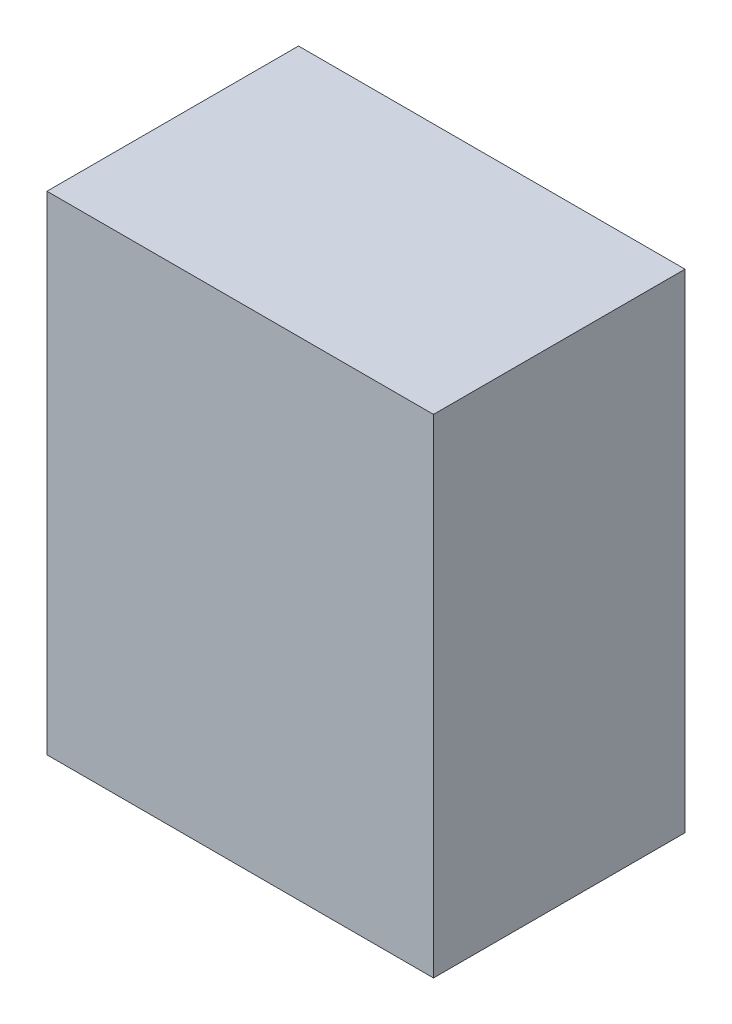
ISO-10303-21;
HEADER;
FILE_DESCRIPTION(('STEP AP214'),'2;1');
FILE_NAME('part.step','',(''),(''),'','','');
FILE_SCHEMA(('AUTOMOTIVE_DESIGN { 1 0 10303 214 1 1 1 1 }'));
ENDSEC;
DATA;
#1=APPLICATION_CONTEXT('core data for automotive mechanical design processes');
#2=APPLICATION_PROTOCOL_DEFINITION('international standard','automotive_design',2000,#1);
#3=PRODUCT_CONTEXT('',#1,'mechanical');
#4=PRODUCT('Part','Part','',(#3));
#5=PRODUCT_RELATED_PRODUCT_CATEGORY('part','',(#4));
#6=PRODUCT_DEFINITION_FORMATION('','',#4);
#7=PRODUCT_DEFINITION_CONTEXT('part definition',#1,'design');
#8=PRODUCT_DEFINITION('design','',#6,#7);
#9=PRODUCT_DEFINITION_SHAPE('','',#8);
#10=(LENGTH_UNIT() NAMED_UNIT(*) SI_UNIT(.MILLI.,.METRE.));
#11=(NAMED_UNIT(*) PLANE_ANGLE_UNIT() SI_UNIT($,.RADIAN.));
#12=(NAMED_UNIT(*) SI_UNIT($,.STERADIAN.) SOLID_ANGLE_UNIT());
#13=UNCERTAINTY_MEASURE_WITH_UNIT(LENGTH_MEASURE(1.E-05),#10,'distance_accuracy_value','');
#14=(GEOMETRIC_REPRESENTATION_CONTEXT(3) GLOBAL_UNCERTAINTY_ASSIGNED_CONTEXT((#13)) GLOBAL_UNIT_ASSIGNED_CONTEXT((#10,
#11,#12)) REPRESENTATION_CONTEXT('',''));
#15=CARTESIAN_POINT('',(0.,0.,0.));
#16=DIRECTION('',(0.,0.,1.));
#17=DIRECTION('',(1.,0.,0.));
#18=AXIS2_PLACEMENT_3D('',#15,#16,#17);
#19=CARTESIAN_POINT('',(169.031366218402,274.692265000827,110.));
#20=DIRECTION('',(-1.,0.,0.));
#21=DIRECTION('',(0.,0.,1.));
#22=AXIS2_PLACEMENT_3D('',#19,#20,#21);
#23=PLANE('',#22);
#24=DIRECTION('',(0.,1.,0.));
#25=VECTOR('',#24,1.);
#26=CARTESIAN_POINT('',(169.031366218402,274.692265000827,-110.));
#27=LINE('',#26,#25);
#28=CARTESIAN_POINT('',(169.031366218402,-152.208498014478,-110.));
#29=VERTEX_POINT('',#28);
#30=CARTESIAN_POINT('',(169.031366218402,274.692265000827,-110.));
#31=VERTEX_POINT('',#30);
#32=EDGE_CURVE('E768',#29,#31,#27,.T.);
#33=ORIENTED_EDGE('',*,*,#32,.T.);
#34=DIRECTION('',(0.,0.,-1.));
#35=VECTOR('',#34,1.);
#36=CARTESIAN_POINT('',(169.031366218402,274.692265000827,110.));
#37=LINE('',#36,#35);
#38=CARTESIAN_POINT('',(169.031366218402,274.692265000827,110.));
#39=VERTEX_POINT('',#38);
#40=EDGE_CURVE('E16',#39,#31,#37,.T.);
#41=ORIENTED_EDGE('',*,*,#40,.F.);
#42=DIRECTION('',(0.,1.,0.));
#43=VECTOR('',#42,1.);
#44=CARTESIAN_POINT('',(169.031366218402,274.692265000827,110.));
#45=LINE('',#44,#43);
#46=CARTESIAN_POINT('',(169.031366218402,-152.208498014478,110.));
#47=VERTEX_POINT('',#46);
#48=EDGE_CURVE('E756',#47,#39,#45,.T.);
#49=ORIENTED_EDGE('',*,*,#48,.F.);
#50=DIRECTION('',(0.,0.,-1.));
#51=VECTOR('',#50,1.);
#52=CARTESIAN_POINT('',(169.031366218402,-152.208498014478,110.));
#53=LINE('',#52,#51);
#54=EDGE_CURVE('E764',#47,#29,#53,.T.);
#55=ORIENTED_EDGE('',*,*,#54,.T.);
#56=EDGE_LOOP('',(#33,#41,#49,#55));
#57=FACE_BOUND('',#56,.T.);
#58=ADVANCED_FACE('F705',(#57),#23,.F.);
#59=CARTESIAN_POINT('',(-169.031366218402,274.692265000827,110.));
#60=DIRECTION('',(0.,-1.,0.));
#61=DIRECTION('',(0.,0.,-1.));
#62=AXIS2_PLACEMENT_3D('',#59,#60,#61);
#63=PLANE('',#62);
#64=DIRECTION('',(-1.,0.,0.));
#65=VECTOR('',#64,1.);
#66=CARTESIAN_POINT('',(-169.031366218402,274.692265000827,-110.));
#67=LINE('',#66,#65);
#68=CARTESIAN_POINT('',(-169.031366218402,274.692265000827,-110.));
#69=VERTEX_POINT('',#68);
#70=EDGE_CURVE('E760',#31,#69,#67,.T.);
#71=ORIENTED_EDGE('',*,*,#70,.T.);
#72=DIRECTION('',(0.,0.,-1.));
#73=VECTOR('',#72,1.);
#74=CARTESIAN_POINT('',(-169.031366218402,274.692265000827,110.));
#75=LINE('',#74,#73);
#76=CARTESIAN_POINT('',(-169.031366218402,274.692265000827,110.));
#77=VERTEX_POINT('',#76);
#78=EDGE_CURVE('E713',#77,#69,#75,.T.);
#79=ORIENTED_EDGE('',*,*,#78,.F.);
#80=DIRECTION('',(-1.,0.,0.));
#81=VECTOR('',#80,1.);
#82=CARTESIAN_POINT('',(-169.031366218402,274.692265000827,110.));
#83=LINE('',#82,#81);
#84=EDGE_CURVE('E751',#39,#77,#83,.T.);
#85=ORIENTED_EDGE('',*,*,#84,.F.);
#86=ORIENTED_EDGE('',*,*,#40,.T.);
#87=EDGE_LOOP('',(#71,#79,#85,#86));
#88=FACE_BOUND('',#87,.T.);
#89=ADVANCED_FACE('F759',(#88),#63,.F.);
#90=CARTESIAN_POINT('',(-169.031366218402,274.692265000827,110.));
#91=DIRECTION('',(1.,0.,0.));
#92=DIRECTION('',(0.,0.,-1.));
#93=AXIS2_PLACEMENT_3D('',#90,#91,#92);
#94=PLANE('',#93);
#95=DIRECTION('',(0.,-1.,0.));
#96=VECTOR('',#95,1.);
#97=CARTESIAN_POINT('',(-169.031366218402,274.692265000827,-110.));
#98=LINE('',#97,#96);
#99=CARTESIAN_POINT('',(-169.031366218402,-152.208498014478,-110.));
#100=VERTEX_POINT('',#99);
#101=EDGE_CURVE('E738',#69,#100,#98,.T.);
#102=ORIENTED_EDGE('',*,*,#101,.T.);
#103=DIRECTION('',(0.,0.,-1.));
#104=VECTOR('',#103,1.);
#105=CARTESIAN_POINT('',(-169.031366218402,-152.208498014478,110.));
#106=LINE('',#105,#104);
#107=CARTESIAN_POINT('',(-169.031366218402,-152.208498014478,110.));
#108=VERTEX_POINT('',#107);
#109=EDGE_CURVE('E761',#108,#100,#106,.T.);
#110=ORIENTED_EDGE('',*,*,#109,.F.);
#111=DIRECTION('',(0.,-1.,0.));
#112=VECTOR('',#111,1.);
#113=CARTESIAN_POINT('',(-169.031366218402,274.692265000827,110.));
#114=LINE('',#113,#112);
#115=EDGE_CURVE('E754',#77,#108,#114,.T.);
#116=ORIENTED_EDGE('',*,*,#115,.F.);
#117=ORIENTED_EDGE('',*,*,#78,.T.);
#118=EDGE_LOOP('',(#102,#110,#116,#117));
#119=FACE_BOUND('',#118,.T.);
#120=ADVANCED_FACE('F762',(#119),#94,.F.);
#121=CARTESIAN_POINT('',(-169.031366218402,-152.208498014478,110.));
#122=DIRECTION('',(0.,1.,0.));
#123=DIRECTION('',(0.,0.,1.));
#124=AXIS2_PLACEMENT_3D('',#121,#122,#123);
#125=PLANE('',#124);
#126=DIRECTION('',(1.,0.,0.));
#127=VECTOR('',#126,1.);
#128=CARTESIAN_POINT('',(-169.031366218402,-152.208498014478,-110.));
#129=LINE('',#128,#127);
#130=EDGE_CURVE('E744',#100,#29,#129,.T.);
#131=ORIENTED_EDGE('',*,*,#130,.T.);
#132=ORIENTED_EDGE('',*,*,#54,.F.);
#133=DIRECTION('',(1.,0.,0.));
#134=VECTOR('',#133,1.);
#135=CARTESIAN_POINT('',(-169.031366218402,-152.208498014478,110.));
#136=LINE('',#135,#134);
#137=EDGE_CURVE('E721',#108,#47,#136,.T.);
#138=ORIENTED_EDGE('',*,*,#137,.F.);
#139=ORIENTED_EDGE('',*,*,#109,.T.);
#140=EDGE_LOOP('',(#131,#132,#138,#139));
#141=FACE_BOUND('',#140,.T.);
#142=ADVANCED_FACE('F775',(#141),#125,.F.);
#143=CARTESIAN_POINT('',(0.,0.,110.));
#144=DIRECTION('',(0.,0.,1.));
#145=DIRECTION('',(1.,0.,0.));
#146=AXIS2_PLACEMENT_3D('',#143,#144,#145);
#147=PLANE('',#146);
#148=ORIENTED_EDGE('',*,*,#48,.T.);
#149=ORIENTED_EDGE('',*,*,#84,.T.);
#150=ORIENTED_EDGE('',*,*,#115,.T.);
#151=ORIENTED_EDGE('',*,*,#137,.T.);
#152=EDGE_LOOP('',(#148,#149,#150,#151));
#153=FACE_BOUND('',#152,.T.);
#154=ADVANCED_FACE('F752',(#153),#147,.T.);
#155=CARTESIAN_POINT('',(0.,0.,-110.));
#156=DIRECTION('',(0.,0.,1.));
#157=DIRECTION('',(1.,0.,0.));
#158=AXIS2_PLACEMENT_3D('',#155,#156,#157);
#159=PLANE('',#158);
#160=ORIENTED_EDGE('',*,*,#32,.F.);
#161=ORIENTED_EDGE('',*,*,#130,.F.);
#162=ORIENTED_EDGE('',*,*,#101,.F.);
#163=ORIENTED_EDGE('',*,*,#70,.F.);
#164=EDGE_LOOP('',(#160,#161,#162,#163));
#165=FACE_BOUND('',#164,.T.);
#166=ADVANCED_FACE('F778',(#165),#159,.F.);
#167=CLOSED_SHELL('',(#58,#89,#120,#142,#154,#166));
#168=MANIFOLD_SOLID_BREP('B2',#167);
#169=ADVANCED_BREP_SHAPE_REPRESENTATION('',(#18,#168),#14);
#170=SHAPE_DEFINITION_REPRESENTATION(#9,#169);
ENDSEC;
END-ISO-10303-21;
